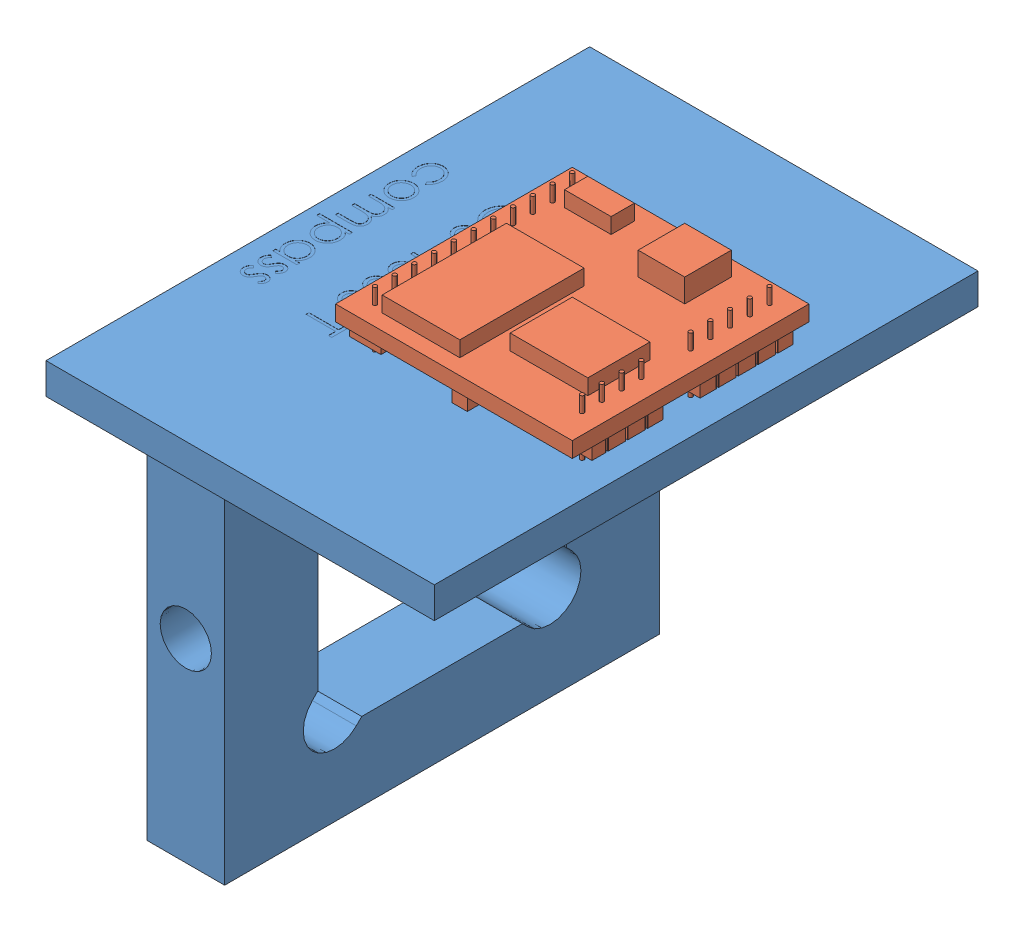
SolidWorks assembly Assemblage1.sldasm, configuration Défaut (file format 4400). Lengths in mm.
Overall size (25 31.1 35).
2 component instances, 2 part files, 3 mates.
Components (placement in the parent):
- OS4000_support-1: OS4000_support.SLDPRT [Défaut] at (-7.8914 10.7001 0) size (25 27 35)
- OS4000-T_Compass-1: OS4000-T_Compass.SLDPRT [Défaut] at (0.8686 14.3001 7.62) size (15.24 6.5 15.24)
Mates (geometry in assembly coordinates):
- Distance1: distance = 0.4 mm aligned: plane of OS4000-T_Compass-1 through (14.7113 10.3001 5.8423) normal (0 -1 0); plane of OS4000_support-1 through (-7.8914 10.7001 17.5) normal (0 -1 0)
- Distance2: distance = 1 mm aligned: plane of OS4000-T_Compass-1 through (16.1086 14.3001 -7.62) normal (1 0 0); plane of OS4000_support-1 through (17.1086 10.7001 17.5) normal (1 0 0)
- Distance3: distance = 9.88 mm aligned: plane of OS4000-T_Compass-1 through (16.1086 14.3001 7.62) normal (0 0 1); plane of OS4000_support-1 through (-7.8914 12.7001 17.5) normal (0 0 1)
